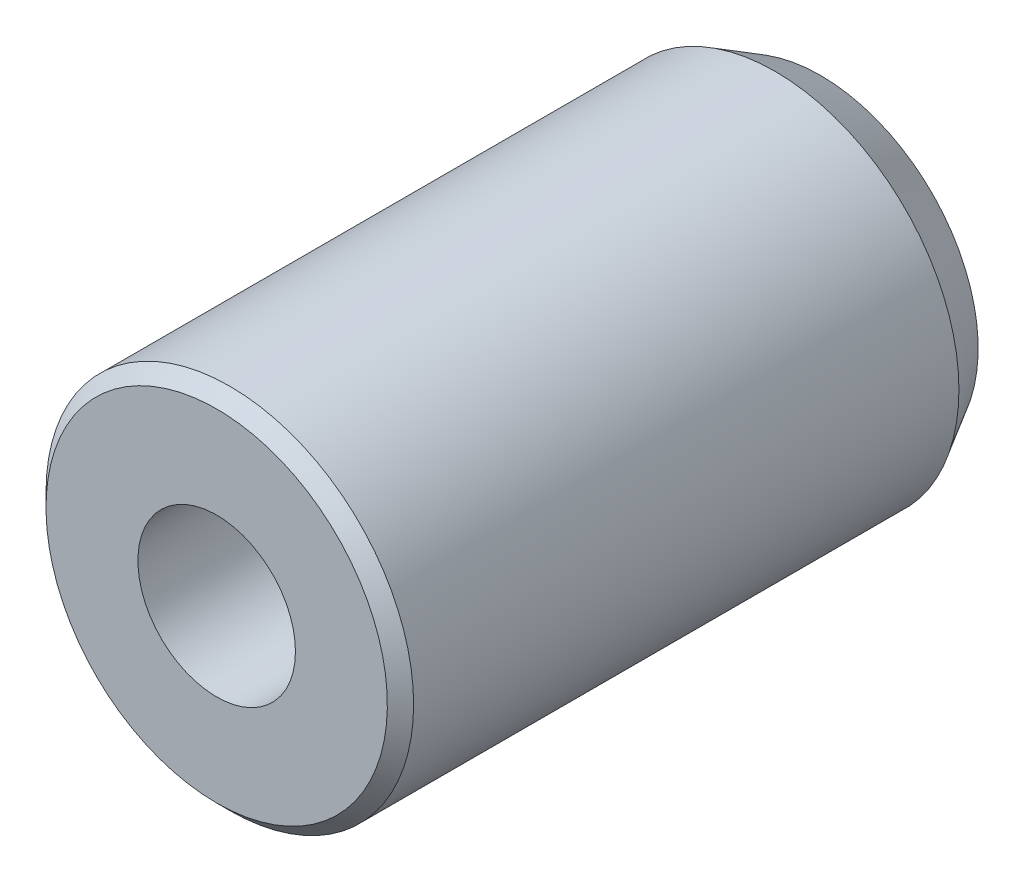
ISO-10303-21;
HEADER;
FILE_DESCRIPTION(('STEP AP214'),'2;1');
FILE_NAME('part.step','',(''),(''),'','','');
FILE_SCHEMA(('AUTOMOTIVE_DESIGN { 1 0 10303 214 1 1 1 1 }'));
ENDSEC;
DATA;
#1=APPLICATION_CONTEXT('core data for automotive mechanical design processes');
#2=APPLICATION_PROTOCOL_DEFINITION('international standard','automotive_design',2000,#1);
#3=PRODUCT_CONTEXT('',#1,'mechanical');
#4=PRODUCT('Part','Part','',(#3));
#5=PRODUCT_RELATED_PRODUCT_CATEGORY('part','',(#4));
#6=PRODUCT_DEFINITION_FORMATION('','',#4);
#7=PRODUCT_DEFINITION_CONTEXT('part definition',#1,'design');
#8=PRODUCT_DEFINITION('design','',#6,#7);
#9=PRODUCT_DEFINITION_SHAPE('','',#8);
#10=(LENGTH_UNIT() NAMED_UNIT(*) SI_UNIT(.MILLI.,.METRE.));
#11=(NAMED_UNIT(*) PLANE_ANGLE_UNIT() SI_UNIT($,.RADIAN.));
#12=(NAMED_UNIT(*) SI_UNIT($,.STERADIAN.) SOLID_ANGLE_UNIT());
#13=UNCERTAINTY_MEASURE_WITH_UNIT(LENGTH_MEASURE(1.E-05),#10,'distance_accuracy_value','');
#14=(GEOMETRIC_REPRESENTATION_CONTEXT(3) GLOBAL_UNCERTAINTY_ASSIGNED_CONTEXT((#13)) GLOBAL_UNIT_ASSIGNED_CONTEXT((#10,
#11,#12)) REPRESENTATION_CONTEXT('',''));
#15=CARTESIAN_POINT('',(0.,0.,0.));
#16=DIRECTION('',(0.,0.,1.));
#17=DIRECTION('',(1.,0.,0.));
#18=AXIS2_PLACEMENT_3D('',#15,#16,#17);
#19=CARTESIAN_POINT('',(0.,0.,39.));
#20=DIRECTION('',(0.,0.,1.));
#21=DIRECTION('',(0.,-1.,0.));
#22=AXIS2_PLACEMENT_3D('',#19,#20,#21);
#23=PLANE('',#22);
#24=CARTESIAN_POINT('',(0.,0.,39.));
#25=DIRECTION('',(0.,0.,1.));
#26=DIRECTION('',(0.,-1.,0.));
#27=AXIS2_PLACEMENT_3D('',#24,#25,#26);
#28=CIRCLE('',#27,6.5);
#29=CARTESIAN_POINT('',(0.,-6.5,39.));
#30=VERTEX_POINT('',#29);
#31=EDGE_CURVE('E29',#30,#30,#28,.T.);
#32=ORIENTED_EDGE('',*,*,#31,.T.);
#33=EDGE_LOOP('',(#32));
#34=FACE_BOUND('',#33,.T.);
#35=CARTESIAN_POINT('',(0.,0.,39.));
#36=DIRECTION('',(0.,0.,1.));
#37=DIRECTION('',(1.,0.,0.));
#38=AXIS2_PLACEMENT_3D('',#35,#36,#37);
#39=CIRCLE('',#38,3.);
#40=CARTESIAN_POINT('',(3.,0.,39.));
#41=VERTEX_POINT('',#40);
#42=EDGE_CURVE('E37',#41,#41,#39,.T.);
#43=ORIENTED_EDGE('',*,*,#42,.F.);
#44=EDGE_LOOP('',(#43));
#45=FACE_BOUND('',#44,.T.);
#46=ADVANCED_FACE('F14',(#34,#45),#23,.T.);
#47=CARTESIAN_POINT('',(0.,0.,16.));
#48=DIRECTION('',(0.,0.,1.));
#49=DIRECTION('',(0.,-1.,0.));
#50=AXIS2_PLACEMENT_3D('',#47,#48,#49);
#51=PLANE('',#50);
#52=CARTESIAN_POINT('',(0.,0.,16.));
#53=DIRECTION('',(0.,0.,1.));
#54=DIRECTION('',(0.,-1.,0.));
#55=AXIS2_PLACEMENT_3D('',#52,#53,#54);
#56=CIRCLE('',#55,6.);
#57=CARTESIAN_POINT('',(0.,-6.,16.));
#58=VERTEX_POINT('',#57);
#59=EDGE_CURVE('E9',#58,#58,#56,.F.);
#60=ORIENTED_EDGE('',*,*,#59,.T.);
#61=EDGE_LOOP('',(#60));
#62=FACE_BOUND('',#61,.T.);
#63=CARTESIAN_POINT('',(0.,0.,16.));
#64=DIRECTION('',(0.,0.,1.));
#65=DIRECTION('',(0.,-1.,0.));
#66=AXIS2_PLACEMENT_3D('',#63,#64,#65);
#67=CIRCLE('',#66,3.);
#68=CARTESIAN_POINT('',(0.,-3.,16.));
#69=VERTEX_POINT('',#68);
#70=EDGE_CURVE('E34',#69,#69,#67,.F.);
#71=ORIENTED_EDGE('',*,*,#70,.F.);
#72=EDGE_LOOP('',(#71));
#73=FACE_BOUND('',#72,.T.);
#74=ADVANCED_FACE('F45',(#62,#73),#51,.F.);
#75=CARTESIAN_POINT('',(0.,0.,39.));
#76=DIRECTION('',(0.,0.,-1.));
#77=DIRECTION('',(0.,1.,0.));
#78=AXIS2_PLACEMENT_3D('',#75,#76,#77);
#79=CYLINDRICAL_SURFACE('',#78,7.);
#80=CARTESIAN_POINT('',(0.,0.,17.7320508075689));
#81=DIRECTION('',(0.,0.,1.));
#82=DIRECTION('',(0.,-1.,0.));
#83=AXIS2_PLACEMENT_3D('',#80,#81,#82);
#84=CIRCLE('',#83,7.);
#85=CARTESIAN_POINT('',(0.,-7.,17.7320508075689));
#86=VERTEX_POINT('',#85);
#87=EDGE_CURVE('E21',#86,#86,#84,.T.);
#88=ORIENTED_EDGE('',*,*,#87,.T.);
#89=EDGE_LOOP('',(#88));
#90=FACE_BOUND('',#89,.T.);
#91=CARTESIAN_POINT('',(0.,0.,38.5));
#92=DIRECTION('',(0.,0.,1.));
#93=DIRECTION('',(0.,-1.,0.));
#94=AXIS2_PLACEMENT_3D('',#91,#92,#93);
#95=CIRCLE('',#94,7.);
#96=CARTESIAN_POINT('',(0.,-7.,38.5));
#97=VERTEX_POINT('',#96);
#98=EDGE_CURVE('E25',#97,#97,#95,.F.);
#99=ORIENTED_EDGE('',*,*,#98,.T.);
#100=EDGE_LOOP('',(#99));
#101=FACE_BOUND('',#100,.T.);
#102=ADVANCED_FACE('F16',(#90,#101),#79,.T.);
#103=CARTESIAN_POINT('',(0.,0.,39.));
#104=DIRECTION('',(0.,0.,1.));
#105=DIRECTION('',(1.,0.,0.));
#106=AXIS2_PLACEMENT_3D('',#103,#104,#105);
#107=CYLINDRICAL_SURFACE('',#106,3.);
#108=ORIENTED_EDGE('',*,*,#42,.T.);
#109=EDGE_LOOP('',(#108));
#110=FACE_BOUND('',#109,.T.);
#111=ORIENTED_EDGE('',*,*,#70,.T.);
#112=EDGE_LOOP('',(#111));
#113=FACE_BOUND('',#112,.T.);
#114=ADVANCED_FACE('F41',(#110,#113),#107,.F.);
#115=CARTESIAN_POINT('',(0.,0.,39.));
#116=DIRECTION('',(0.,0.,-1.));
#117=DIRECTION('',(0.,1.,0.));
#118=AXIS2_PLACEMENT_3D('',#115,#116,#117);
#119=CONICAL_SURFACE('',#118,6.5,0.785398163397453);
#120=ORIENTED_EDGE('',*,*,#98,.F.);
#121=EDGE_LOOP('',(#120));
#122=FACE_BOUND('',#121,.T.);
#123=ORIENTED_EDGE('',*,*,#31,.F.);
#124=EDGE_LOOP('',(#123));
#125=FACE_BOUND('',#124,.T.);
#126=ADVANCED_FACE('F56',(#122,#125),#119,.T.);
#127=CARTESIAN_POINT('',(0.,0.,17.7320508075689));
#128=DIRECTION('',(0.,0.,1.));
#129=DIRECTION('',(0.,-1.,0.));
#130=AXIS2_PLACEMENT_3D('',#127,#128,#129);
#131=CONICAL_SURFACE('',#130,7.,0.523598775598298);
#132=ORIENTED_EDGE('',*,*,#59,.F.);
#133=EDGE_LOOP('',(#132));
#134=FACE_BOUND('',#133,.T.);
#135=ORIENTED_EDGE('',*,*,#87,.F.);
#136=EDGE_LOOP('',(#135));
#137=FACE_BOUND('',#136,.T.);
#138=ADVANCED_FACE('F59',(#134,#137),#131,.T.);
#139=CLOSED_SHELL('',(#46,#74,#102,#114,#126,#138));
#140=MANIFOLD_SOLID_BREP('B1',#139);
#141=ADVANCED_BREP_SHAPE_REPRESENTATION('',(#18,#140),#14);
#142=SHAPE_DEFINITION_REPRESENTATION(#9,#141);
ENDSEC;
END-ISO-10303-21;
